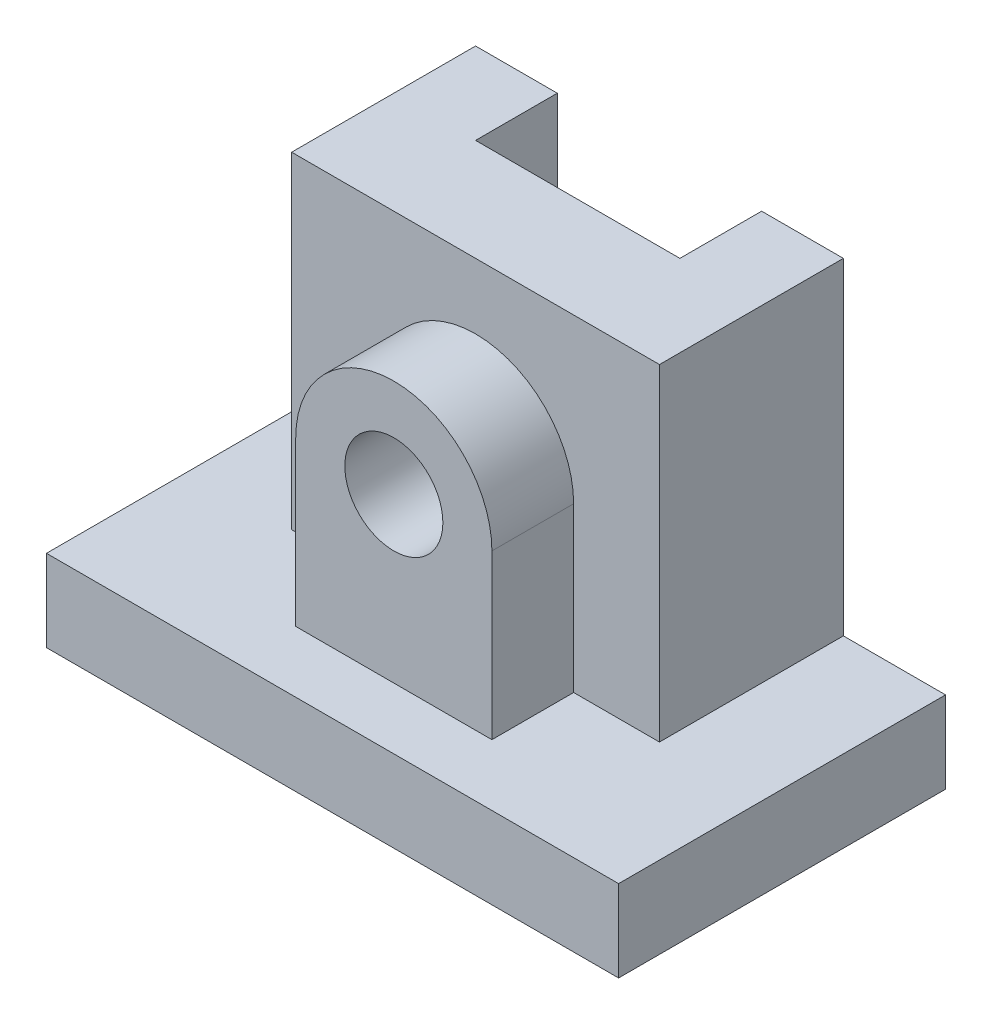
from build123d import *

# Parameters (mm, degrees)
SKETCH_1_W          = 140
SKETCH_1_H          = 80
EXTRUDE_1_DEPTH     = 20
SKETCH_2_W          = 90
SKETCH_2_H          = 45
EXTRUDE_2_DEPTH     = 80
EXTRUDE_3_DEPTH     = 20
SKETCH_4_R          = 12
CUT_EXTRUDE_1_DEPTH = 139.293166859
SKETCH_5_W          = 50
SKETCH_5_H          = 20
CUT_EXTRUDE_2_DEPTH = 146.945195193


with BuildPart() as part:
    # Sketch 1 → Extrude 1 (new body)
    with BuildSketch(Plane(origin=(0, 0, 0), x_dir=(1, 0, 0), z_dir=(0, 1, 0))):
        with Locations((0, -40)):
            Rectangle(SKETCH_1_W, SKETCH_1_H)
    extrude(amount=EXTRUDE_1_DEPTH)

    # Sketch 2 → Extrude 2 (add)
    with BuildSketch(Plane(origin=(0, 20, 0), x_dir=(1, 0, 0), z_dir=(0, 1, 0))):
        with Locations((0, -22.5)):
            Rectangle(SKETCH_2_W, SKETCH_2_H)
    extrude(amount=EXTRUDE_2_DEPTH)

    # Sketch 3 → Extrude 3 (add)
    with BuildSketch(Plane.XY.offset(45)):
        with BuildLine():
            Line((24, 20), (-24, 20))
            Line((-24, 20), (-24, 60))
            ThreePointArc((-24, 60), (0, 84), (24, 60))
            Line((24, 60), (24, 20))
        make_face()
    extrude(amount=EXTRUDE_3_DEPTH)

    # Sketch 4 → Cut-Extrude 1 (cut, through all)
    with BuildSketch(Plane.XY.offset(65)):
        with Locations((0, 60)):
            Circle(SKETCH_4_R)
    extrude(amount=-CUT_EXTRUDE_1_DEPTH, mode=Mode.SUBTRACT)

    # Sketch 5 → Cut-Extrude 2 (cut, through all)
    with BuildSketch(Plane(origin=(0, 100, 0), x_dir=(1, 0, 0), z_dir=(0, 1, 0))):
        with Locations((0, -10)):
            Rectangle(SKETCH_5_W, SKETCH_5_H)
    extrude(amount=-CUT_EXTRUDE_2_DEPTH, mode=Mode.SUBTRACT)


solid = part.part
